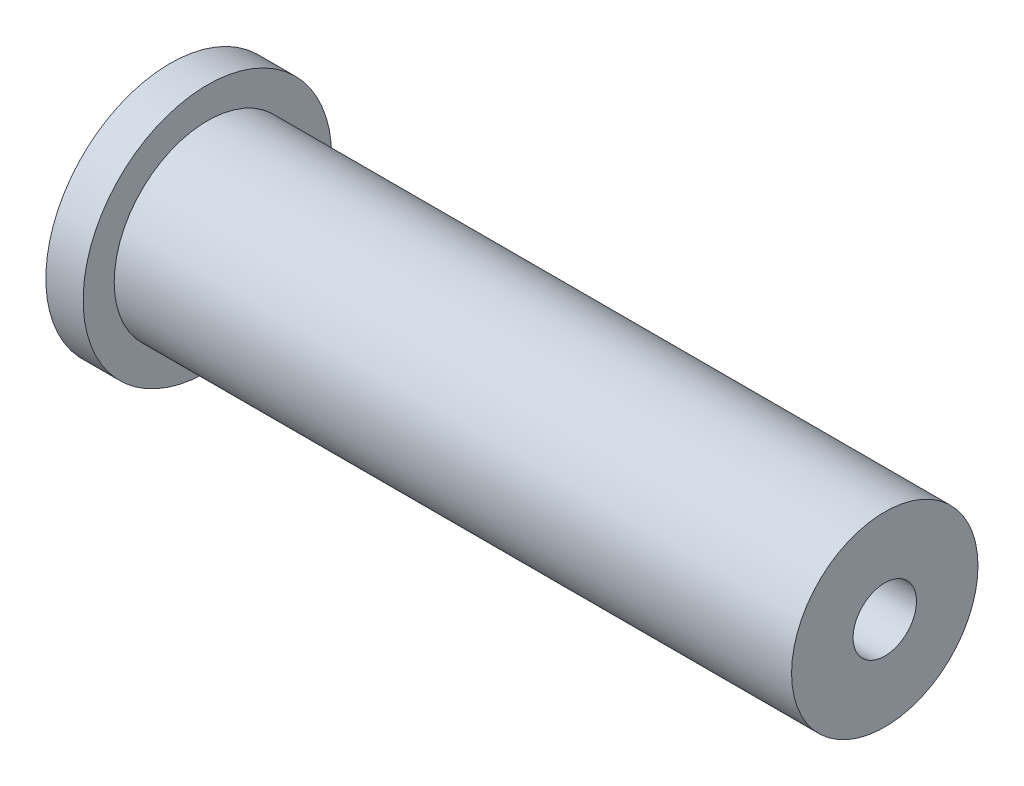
from build123d import *

# Parameters (mm, degrees)
SKETCH2_R          = 2.55
CUT_EXTRUDE1_DEPTH = 10


with BuildPart() as part:
    # Sketch1 → Revolve1 (revolve)
    with BuildSketch(Plane.XY, mode=Mode.PRIVATE) as revolve1_sk:
        Polygon((0, 0), (0, 10), (3, 10), (3, 7.5), (57.5, 7.5), (57.5, 0), align=None)
    revolve(revolve1_sk.sketch.rotate(Axis((0, 0, 0), (-1, 0, 0)), 90), axis=Axis((0, 0, 0), (-1, 0, 0)))

    # Sketch2 → Cut-Extrude1 (cut)
    with BuildSketch(Plane(origin=(57.5, 0, 0), x_dir=(0, 0, -1), z_dir=(1, 0, 0))):
        Circle(SKETCH2_R)
    extrude(amount=-CUT_EXTRUDE1_DEPTH, mode=Mode.SUBTRACT)


solid = part.part
